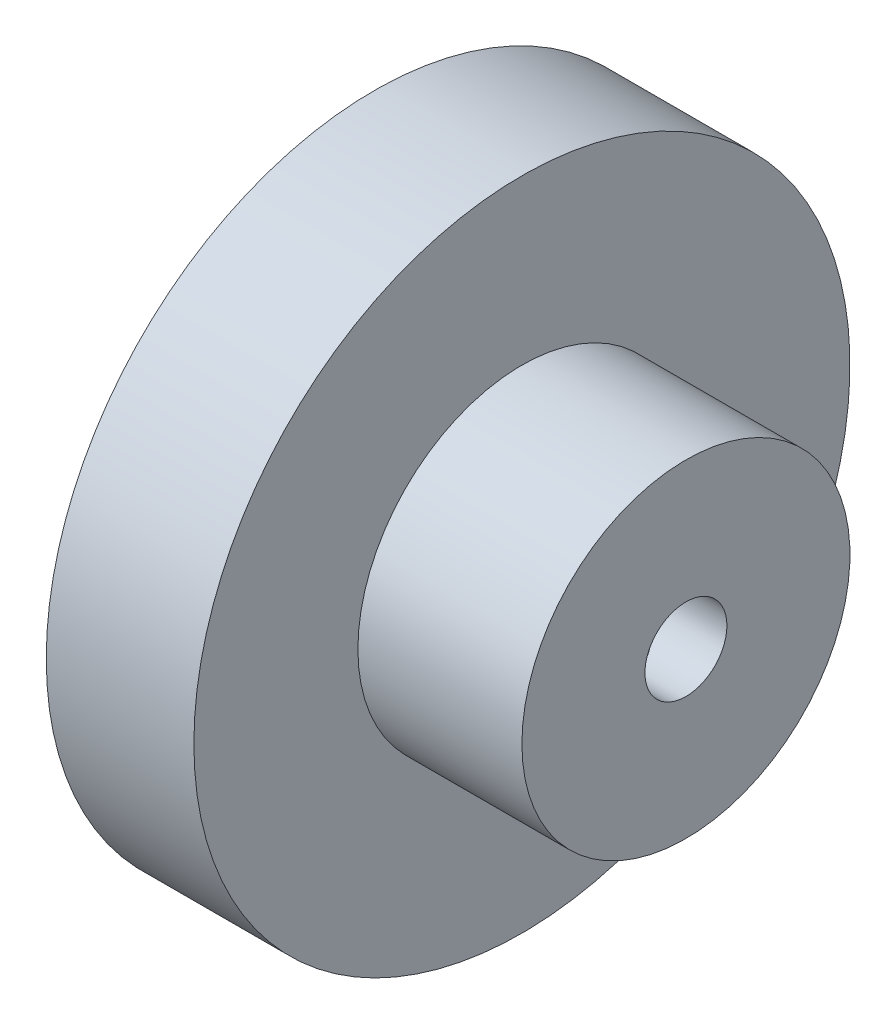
from build123d import *

# Parameters (mm, degrees)
SKETCH2_R          = 2.5
CUT_EXTRUDE1_DEPTH = 35.073450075
SKETCH3_R          = 2
CUT_EXTRUDE2_DEPTH = 10


with BuildPart() as part:
    # Sketch1 → Revolve1 (revolve)
    with BuildSketch(Plane(origin=(0, 0, 0), x_dir=(1, 0, 0), z_dir=(0, 1, 0)), mode=Mode.PRIVATE) as revolve1_sk:
        Polygon((0, 0), (19, 0), (19, 10), (9, 10), (9, 20), (0, 20), align=None)
    revolve(revolve1_sk.sketch.rotate(Axis((0, 0, 0), (1, 0, 0)), 180), axis=Axis((0, 0, 0), (1, 0, 0)))

    # Sketch2 → Cut-Extrude1 (cut, through all)
    with BuildSketch(Plane(origin=(19, 0, 0), x_dir=(0, 0, -1), z_dir=(1, 0, 0))):
        Circle(SKETCH2_R)
    extrude(amount=-CUT_EXTRUDE1_DEPTH, mode=Mode.SUBTRACT)

    # Sketch3 → Cut-Extrude2 (cut)
    with BuildSketch(Plane(origin=(0, 0, 0), x_dir=(1, 0, 0), z_dir=(0, 1, 0))):
        with Locations(Location((14, 0, 0), (0, 0, 270))):
            Circle(SKETCH3_R)
    extrude(amount=-CUT_EXTRUDE2_DEPTH, mode=Mode.SUBTRACT)


solid = part.part
